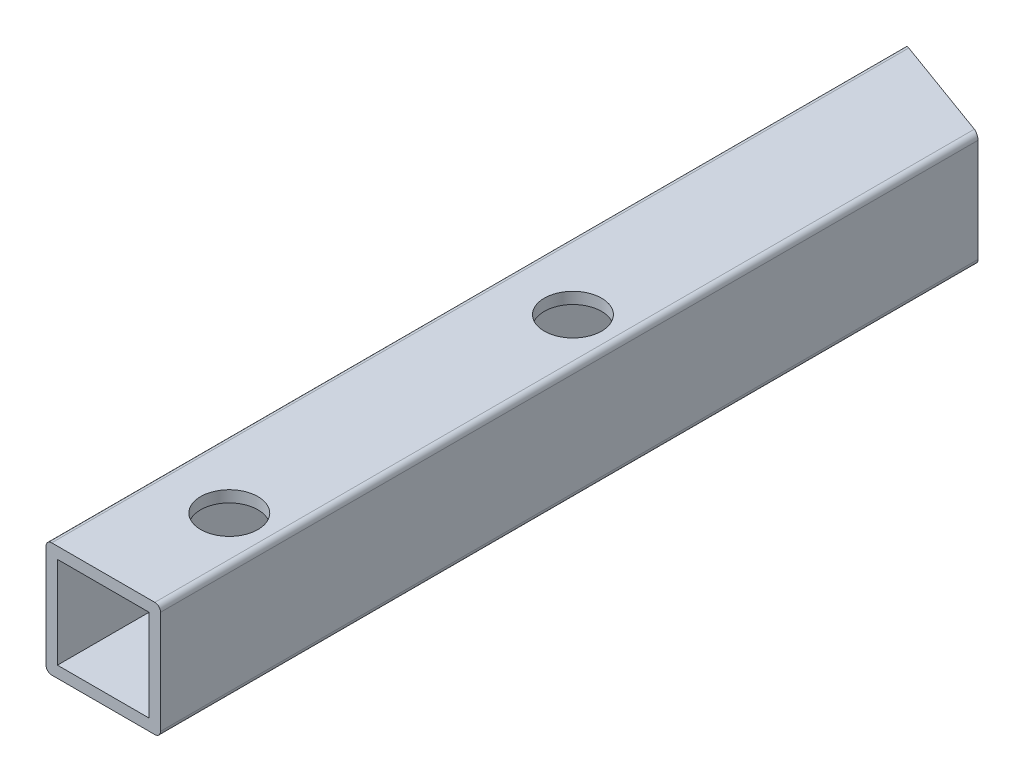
from build123d import *

# Parameters (mm, degrees)
ESQUISSE1_W             = 16
ESQUISSE1_H             = 16
BASE_EXTRU_MINCE_DEPTH  = 150
ESQUISSE3_W             = 198
ESQUISSE3_H             = 92
ENL_V_MAT_EXTRU_3_DEPTH = 148.54969305
ESQUISSE4_R             = 5
ENL_V_MAT_EXTRU_4_DEPTH = 21


with BuildPart() as part:
    # Esquisse1 → Base-Extru.-Mince (new body)
    with BuildSketch(Plane.XY):
        with BuildLine():
            Line((9, -10), (-9, -10))
            ThreePointArc((-9, -10), (-9.707106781, -9.707106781), (-10, -9))
            Line((-10, -9), (-10, 9))
            ThreePointArc((-10, 9), (-9.707106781, 9.707106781), (-9, 10))
            Line((-9, 10), (9, 10))
            ThreePointArc((9, 10), (9.707106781, 9.707106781), (10, 9))
            Line((10, 9), (10, -9))
            ThreePointArc((10, -9), (9.707106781, -9.707106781), (9, -10))
        make_face()
        Rectangle(ESQUISSE1_W, ESQUISSE1_H, mode=Mode.SUBTRACT)
    extrude(amount=BASE_EXTRU_MINCE_DEPTH)

    # Esquisse3 → Enl_v. mat.-Extru.3 (cut, through all)
    with BuildSketch(Plane(origin=(-1.169777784, 0, 3.213938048), x_dir=(-0.9396926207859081, 0, -0.3420201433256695), z_dir=(0.3420201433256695, 0, -0.9396926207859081))):
        with Locations((46, -13)):
            Rectangle(ESQUISSE3_W, ESQUISSE3_H)
    extrude(amount=ENL_V_MAT_EXTRU_3_DEPTH, mode=Mode.SUBTRACT)

    # Esquisse4 → Enl_v. mat.-Extru.4 (cut)
    with BuildSketch(Plane(origin=(0, 10, 0), x_dir=(-1, 0, 0), z_dir=(0, 1, 0))):
        with Locations(Location((-2, 70, 0), (0, 0, 90))):
            Circle(ESQUISSE4_R)
        with Locations(Location((-2, 130, 0), (0, 0, 90))):
            Circle(ESQUISSE4_R)
    extrude(amount=-ENL_V_MAT_EXTRU_4_DEPTH, mode=Mode.SUBTRACT)


solid = part.part
